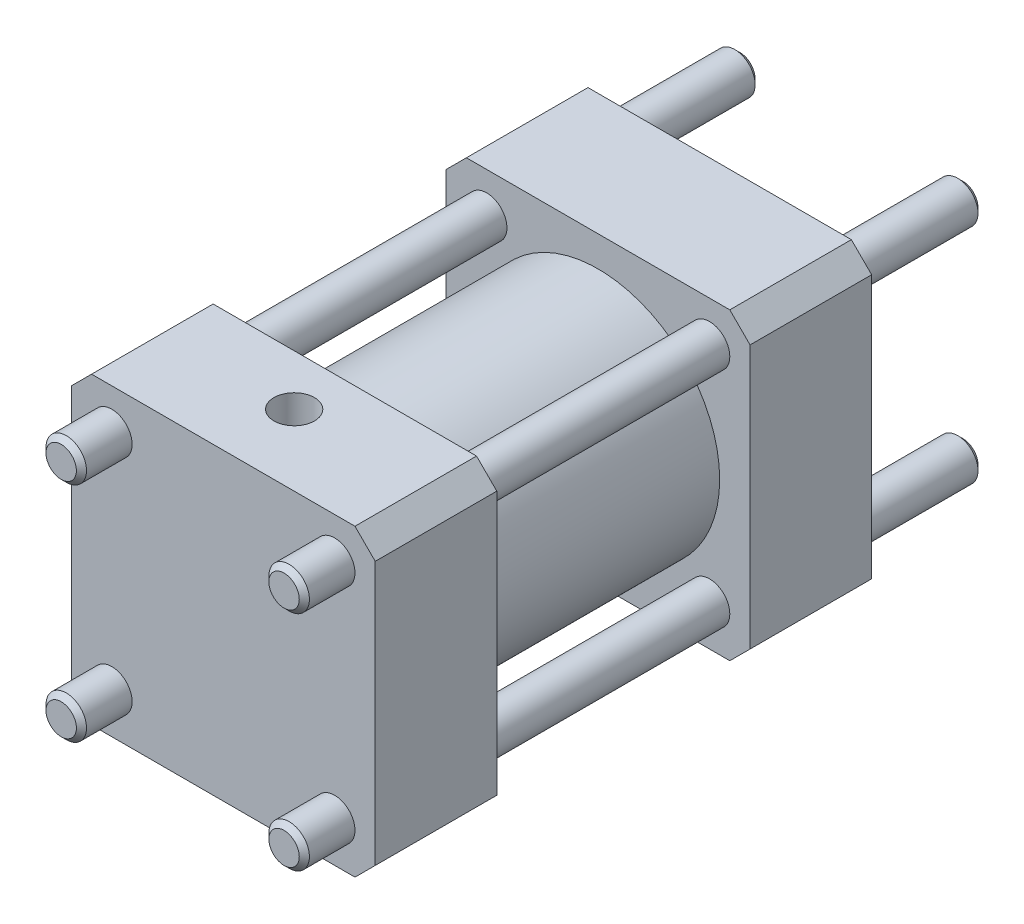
from build123d import *

# Parameters (mm, degrees)
ESQUISSE1_W                       = 30
ESQUISSE1_H                       = 30
BASE_EXTRUSION_DEPTH              = 12
ESQUISSE2_R                       = 12
ESQUISSE2_R_2                     = 10
BOS_EXTRU_MINCE1_DEPTH            = 25
ESQUISSE3_W                       = 30
ESQUISSE3_H                       = 30
BOSS_EXTRU_1_DEPTH                = 12
BOSS_EXTRU_2_REACH                = 58.294
ESQUISSE4_R                       = 2
BOSS_EXTRU_3_REACH                = 53.124
ESQUISSE5_R                       = 2
BOSS_EXTRU_4_REACH                = 64.884
ESQUISSE6_R                       = 2
BOSS_EXTRU_5_REACH                = 69.61
ESQUISSE7_R                       = 2
ESQUISSE10_R                      = 9
BOSS_EXTRU_6_DEPTH                = 6
EXTRUSION1_START                  = 13
ESQUISSE15_R                      = 2
EXTRUSION1_DEPTH                  = 13
ESQUISSE16_R                      = 2
EXTRUSION2_DEPTH                  = 5
CHANFREIN2_SIZE                   = 0.5
CHANFREIN5_SIZE                   = 1
ESQUISSE17_R                      = 4
ENL_V_MAT_EXTRU_1_DEPTH           = 26.67049611
CHANFREIN6_SIZE                   = 2
ESQUISSE24_R                      = 7.5
ESQUISSE24_R_2                    = 6.5
ENL_V_MAT_EXTRU_2_DEPTH           = 8
ESQUISSE25_R                      = 6.5
ENL_V_MAT_EXTRU_3_DEPTH           = 4
CHANFREIN7_SIZE                   = 1
DIAM_TRE_DU_PER_AGE_4_0_4_1_D     = 4
DIAM_TRE_DU_PER_AGE_4_0_4_1_DEPTH = 17
DIAM_TRE_DU_PER_AGE_4_0_4_1_TIP   = 1.201721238
ESQUISSE28_R                      = 2
ENL_V_MAT_EXTRU_4_DEPTH           = 5


with BuildPart() as part:
    # Esquisse1 → Base-Extrusion (new body)
    with BuildSketch(Plane.XY):
        with Locations((15, 15)):
            Rectangle(ESQUISSE1_W, ESQUISSE1_H)
    extrude(amount=BASE_EXTRUSION_DEPTH)

    # Esquisse2 → Bos.-Extru.-Mince1 (add)
    with BuildSketch(Plane.XY.offset(12)):
        with Locations((15, 15)):
            Circle(ESQUISSE2_R)
        with Locations((15, 15)):
            Circle(ESQUISSE2_R_2, mode=Mode.SUBTRACT)
    extrude(amount=BOS_EXTRU_MINCE1_DEPTH)

    # Esquisse3 → Boss.-Extru.1 (add)
    with BuildSketch(Plane.XY.offset(37)):
        with Locations((15, 15)):
            Rectangle(ESQUISSE3_W, ESQUISSE3_H)
    extrude(amount=BOSS_EXTRU_1_DEPTH)

    # Esquisse4 → Boss.-Extru.2 (add, up to next)
    with BuildSketch(Plane.XY.offset(12), mode=Mode.PRIVATE) as boss_extru_2_sk1:
        with Locations(Location((4, 26, 0), (0, 0, 180))):
            Circle(ESQUISSE4_R)
    boss_extru_2_tool1 = extrude(boss_extru_2_sk1.sketch, amount=BOSS_EXTRU_2_REACH, mode=Mode.PRIVATE) - part.part
    add(boss_extru_2_tool1.solids().sort_by_distance((4, 26, 12))[0])

    # Esquisse5 → Boss.-Extru.3 (add, up to next)
    with BuildSketch(Plane(origin=(19.916830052, 0.880144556, 12), x_dir=(1, 0, 0), z_dir=(0, 0, 1)), mode=Mode.PRIVATE) as boss_extru_3_sk1:
        with Locations(Location((6.083169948, 25.119855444, 0), (0, 0, 180))):
            Circle(ESQUISSE5_R)
    boss_extru_3_tool1 = extrude(boss_extru_3_sk1.sketch, amount=BOSS_EXTRU_3_REACH, mode=Mode.PRIVATE) - part.part
    add(boss_extru_3_tool1.solids().sort_by_distance((26, 26, 12))[0])

    # Esquisse6 → Boss.-Extru.4 (add, up to next)
    with BuildSketch(Plane(origin=(19.426828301, -16.989020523, 12), x_dir=(1, 0, 0), z_dir=(0, 0, 1)), mode=Mode.PRIVATE) as boss_extru_4_sk1:
        with Locations(Location((6.573171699, 20.989020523, 0), (0, 0, 180))):
            Circle(ESQUISSE6_R)
    boss_extru_4_tool1 = extrude(boss_extru_4_sk1.sketch, amount=BOSS_EXTRU_4_REACH, mode=Mode.PRIVATE) - part.part
    add(boss_extru_4_tool1.solids().sort_by_distance((26, 4, 12))[0])

    # Esquisse7 → Boss.-Extru.5 (add, up to next)
    with BuildSketch(Plane(origin=(0.731824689, -18.430102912, 12), x_dir=(1, 0, 0), z_dir=(0, 0, 1)), mode=Mode.PRIVATE) as boss_extru_5_sk1:
        with Locations(Location((3.268175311, 22.430102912, 0), (0, 0, 180))):
            Circle(ESQUISSE7_R)
    boss_extru_5_tool1 = extrude(boss_extru_5_sk1.sketch, amount=BOSS_EXTRU_5_REACH, mode=Mode.PRIVATE) - part.part
    add(boss_extru_5_tool1.solids().sort_by_distance((4, 4, 12))[0])

    # Esquisse10 → Boss.-Extru.6 (add)
    with BuildSketch(Plane(origin=(0, 0, 0), x_dir=(-1, 0, 0), z_dir=(0, 0, -1))):
        with Locations(Location((-15, 15, 0), (0, 0, 180))):
            Circle(ESQUISSE10_R)
    extrude(amount=BOSS_EXTRU_6_DEPTH)

    # Esquisse15 → Extrusion1 (add)
    with BuildSketch(Plane(origin=(0, 0, 0), x_dir=(-1, 0, 0), z_dir=(0, 0, -1)).offset(EXTRUSION1_START)):
        with Locations((-4, 26)):
            Circle(ESQUISSE15_R)
        with Locations((-4, 4)):
            Circle(ESQUISSE15_R)
        with Locations((-26, 4)):
            Circle(ESQUISSE15_R)
        with Locations((-26, 26)):
            Circle(ESQUISSE15_R)
    extrude(amount=-EXTRUSION1_DEPTH)

    # Esquisse16 → Extrusion2 (add)
    with BuildSketch(Plane.XY.offset(49)):
        with Locations(Location((26, 26, 0), (0, 0, 180))):
            Circle(ESQUISSE16_R)
        with Locations(Location((26, 4, 0), (0, 0, 180))):
            Circle(ESQUISSE16_R)
        with Locations(Location((4, 4, 0), (0, 0, 180))):
            Circle(ESQUISSE16_R)
        with Locations(Location((4, 26, 0), (0, 0, 180))):
            Circle(ESQUISSE16_R)
    extrude(amount=EXTRUSION2_DEPTH)

    # Chanfrein2
    chanfrein2_edges = [part.edges().sort_by_distance(p)[0] for p in [
        (6, 26, -13),
        (6, 4, -13),
        (28, 4, -13),
        (28, 26, -13),
        (28, 26, 54),
        (28, 4, 54),
        (6, 4, 54),
        (6, 26, 54),
    ]]
    chamfer(chanfrein2_edges, length=CHANFREIN2_SIZE)

    # Chanfrein5
    chanfrein5_edges = [part.edges().sort_by_distance(p)[0] for p in [
        (6, 15, -6),
    ]]
    chamfer(chanfrein5_edges, length=CHANFREIN5_SIZE)

    # Esquisse17 → Enl_v. mat.-Extru.1 (cut)
    with BuildSketch(Plane(origin=(0, 0, -6), x_dir=(-1, 0, 0), z_dir=(0, 0, -1))):
        with Locations((-15, 15)):
            Circle(ESQUISSE17_R)
    extrude(amount=-ENL_V_MAT_EXTRU_1_DEPTH, mode=Mode.SUBTRACT)

    # Chanfrein6
    chanfrein6_edges = [part.edges().sort_by_distance(p)[0] for p in [
        (0, 30, 43),
        (0, 0, 43),
        (30, 0, 43),
        (30, 30, 43),
        (0, 30, 6),
        (30, 30, 6),
        (30, 0, 6),
        (0, 0, 6),
    ]]
    chamfer(chanfrein6_edges, length=CHANFREIN6_SIZE)

    # Esquisse24 → Enl_v. mat.-Extru.2 (cut)
    with BuildSketch(Plane.XY.offset(12)):
        with Locations((15, 15)):
            Circle(ESQUISSE24_R)
        with Locations((15, 15)):
            Circle(ESQUISSE24_R_2, mode=Mode.SUBTRACT)
    extrude(amount=-ENL_V_MAT_EXTRU_2_DEPTH, mode=Mode.SUBTRACT)

    # Esquisse25 → Enl_v. mat.-Extru.3 (cut)
    with BuildSketch(Plane.XY.offset(12)):
        with Locations((15, 15)):
            Circle(ESQUISSE25_R)
    extrude(amount=-ENL_V_MAT_EXTRU_3_DEPTH, mode=Mode.SUBTRACT)

    # Chanfrein7
    chanfrein7_edges = [part.edges().sort_by_distance(p)[0] for p in [
        (8.5, 15, 8),
    ]]
    chamfer(chanfrein7_edges, length=CHANFREIN7_SIZE)

    # Diam_tre du per_age _4.0 _4_1
    with Locations(Plane(origin=(0, 30, 0), x_dir=(-1, 0, 0), z_dir=(0, 1, 0))):
        with Locations((-15, 42)):
            Hole(DIAM_TRE_DU_PER_AGE_4_0_4_1_D / 2, depth=DIAM_TRE_DU_PER_AGE_4_0_4_1_DEPTH)
            with Locations((0, 0, -(DIAM_TRE_DU_PER_AGE_4_0_4_1_DEPTH + DIAM_TRE_DU_PER_AGE_4_0_4_1_TIP / 2))):  # 118° drill point
                Cone(0, DIAM_TRE_DU_PER_AGE_4_0_4_1_D / 2, DIAM_TRE_DU_PER_AGE_4_0_4_1_TIP, mode=Mode.SUBTRACT)

    # Esquisse28 → Enl_v. mat.-Extru.4 (cut)
    with BuildSketch(Plane(origin=(0, 0, 37), x_dir=(-1, 0, 0), z_dir=(0, 0, -1))):
        with Locations((-15, 15)):
            Circle(ESQUISSE28_R)
    extrude(amount=-ENL_V_MAT_EXTRU_4_DEPTH, mode=Mode.SUBTRACT)


solid = part.part
